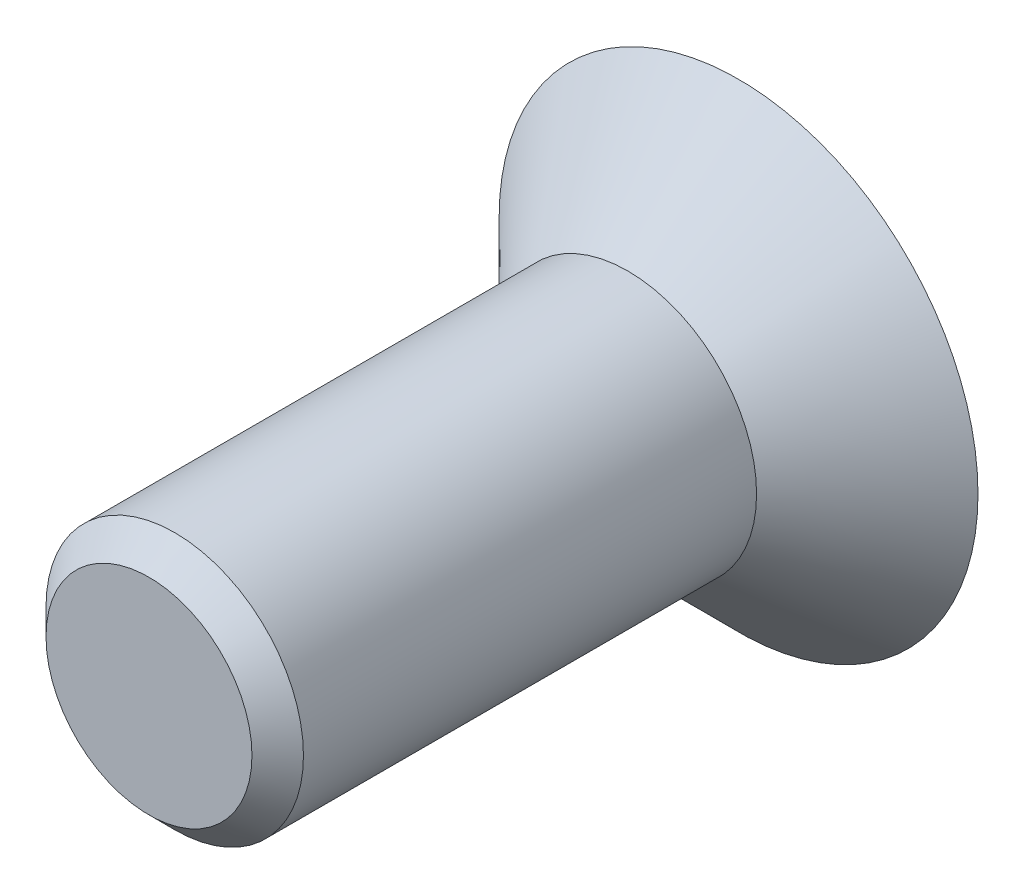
from build123d import *

# Parameters (mm, degrees)
FENTE1_DEPTH    = 2.4
ESQUISSE3_W     = 2.5
ESQUISSE3_H     = 9.3
CHANFREIN1_SIZE = 0.5


with BuildPart() as part:
    # Esquisse1 → Base-R_volution (revolve)
    with BuildSketch(Plane(origin=(0, 0, 0), x_dir=(1, 0, 0), z_dir=(0, 1, 0)), mode=Mode.PRIVATE) as base_r_volution_sk:
        Polygon((2.5, 0), (4.65, 2.15), (0, 2.15), (0, 0), align=None)
    revolve(base_r_volution_sk.sketch.rotate(Axis((0, 0, 0), (0, 0, -1)), 180), axis=Axis((0, 0, 0), (0, 0, -1)))

    # Esquisse2 → fente1 (cut)
    with BuildSketch(Plane.XY.offset(-2.15)):
        Polygon((1.5, -0.866025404), (1.5, 0.866025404), (0, 1.732050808), (-1.5, 0.866025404), (-1.5, -0.866025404), (0, -1.732050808), align=None)
    extrude(amount=FENTE1_DEPTH, mode=Mode.SUBTRACT)

    # Esquisse3 → Boss.-R_vol.1 (revolve)
    with BuildSketch(Plane(origin=(0, 0, 0), x_dir=(1, 0, 0), z_dir=(0, 1, 0)), mode=Mode.PRIVATE) as boss_r_vol_1_sk:
        with Locations((1.25, -4.65)):
            Rectangle(ESQUISSE3_W, ESQUISSE3_H)
    revolve(boss_r_vol_1_sk.sketch.rotate(Axis((0, 0, 0), (0, 0, 1)), 180), axis=Axis((0, 0, 0), (0, 0, 1)))

    # Chanfrein1
    chanfrein1_edges = [part.edges().sort_by_distance(p)[0] for p in [
        (2.5, 0, 9.3),
    ]]
    chamfer(chanfrein1_edges, length=CHANFREIN1_SIZE)


solid = part.part
